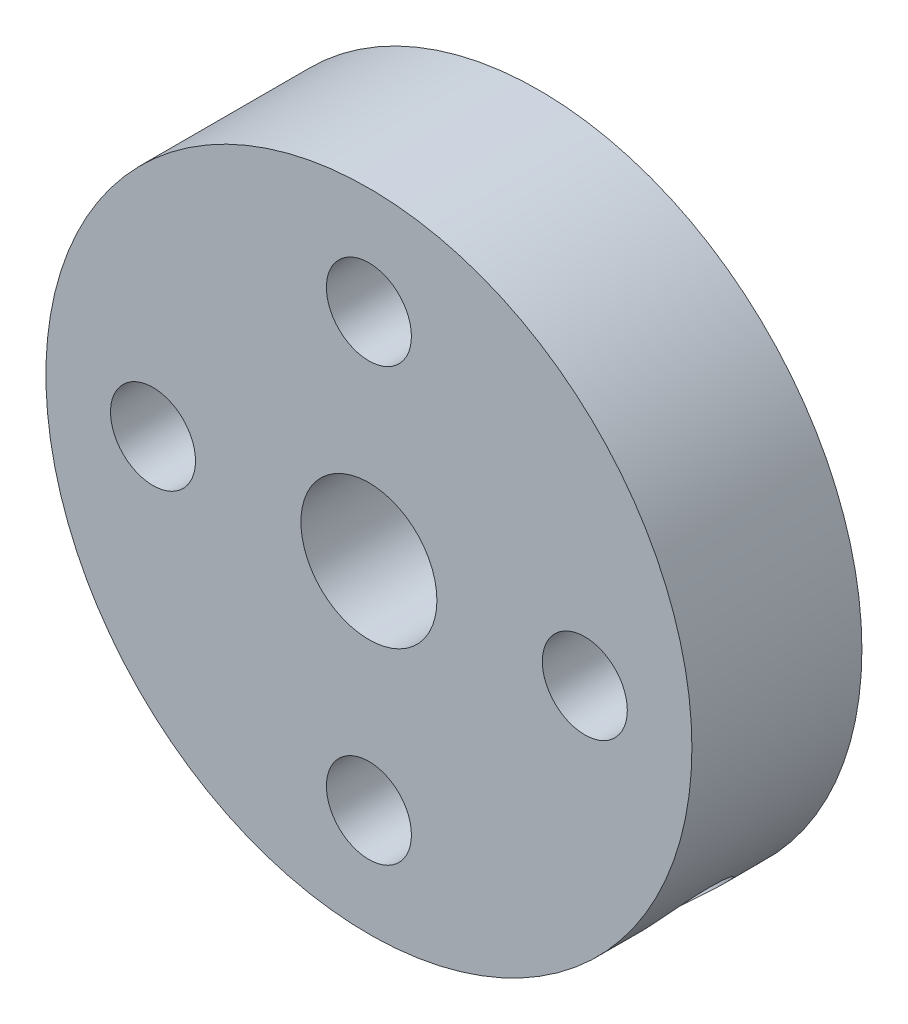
from build123d import *

# Parameters (mm, degrees)
SKETCH1_R                  = 9.5
BOSS_EXTRUDE1_DEPTH        = 5
F_4_0_4_DIAMETER_HOLE1_D   = 4
M3X0_5_TAPPED_HOLE1_D      = 2.5
M3X0_5_TAPPED_HOLE4_REACH  = 25.474
M3X0_5_TAPPED_HOLE4_BORE_R = 1.25


with BuildPart() as part:
    # Sketch1 → Boss-Extrude1 (new body)
    with BuildSketch(Plane.XY):
        Circle(SKETCH1_R)
    extrude(amount=BOSS_EXTRUDE1_DEPTH)

    # 4.0 _4_ Diameter Hole1 (through all)
    with Locations(Plane.XY.offset(5)):
        with Locations((0, 0)):
            Hole(F_4_0_4_DIAMETER_HOLE1_D / 2)

    # M3x0.5 Tapped Hole1 (through all)
    with Locations(Plane.XY.offset(5)):
        with Locations((6.35, 0), (0, -6.35), (-6.35, 0), (0, 6.35), (0, 0)):
            Hole(M3X0_5_TAPPED_HOLE1_D / 2)

    # M3x0.5 Tapped Hole4 bore → M3x0.5 Tapped Hole4 (cut, up to next)
    with BuildSketch(Plane(origin=(6.717514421, -6.717514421, 0), x_dir=(-0.7071067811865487, -0.7071067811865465, 0), z_dir=(0.7071067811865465, -0.7071067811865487, 0)), mode=Mode.PRIVATE) as m3x0_5_tapped_hole4_sk1:
        with Locations((0, -2.5)):
            Circle(M3X0_5_TAPPED_HOLE4_BORE_R)
    m3x0_5_tapped_hole4_tool1 = extrude(m3x0_5_tapped_hole4_sk1.sketch, amount=-M3X0_5_TAPPED_HOLE4_REACH, mode=Mode.PRIVATE) & part.part
    add(m3x0_5_tapped_hole4_tool1.solids().sort_by_distance((6.717514, -6.717514, 2.5))[0], mode=Mode.SUBTRACT)


solid = part.part
